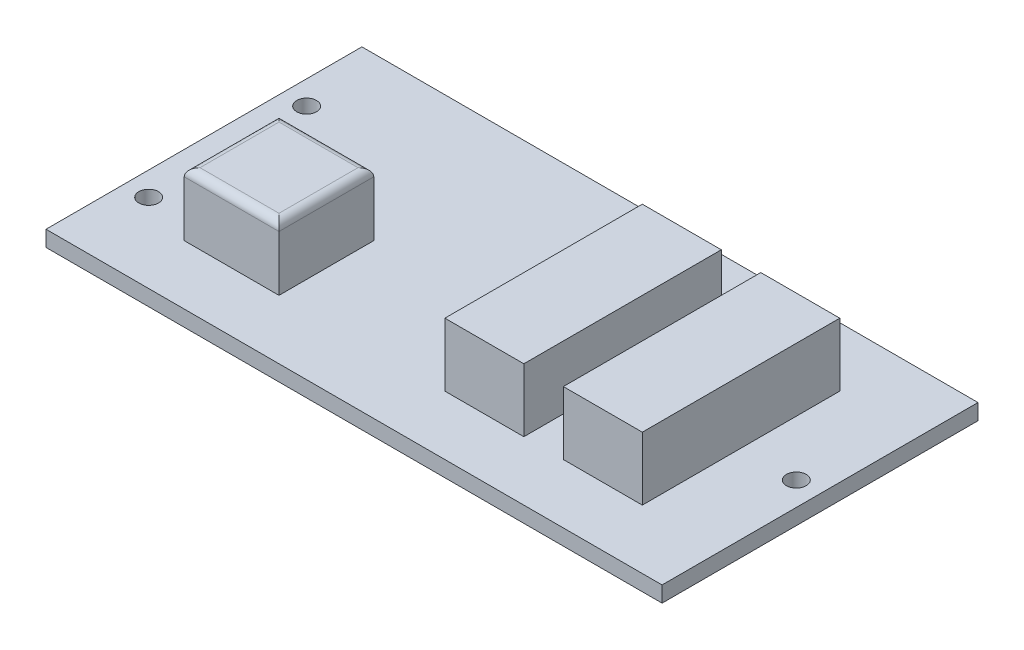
ISO-10303-21;
HEADER;
FILE_DESCRIPTION(('STEP AP214'),'2;1');
FILE_NAME('part.step','',(''),(''),'','','');
FILE_SCHEMA(('AUTOMOTIVE_DESIGN { 1 0 10303 214 1 1 1 1 }'));
ENDSEC;
DATA;
#1=APPLICATION_CONTEXT('core data for automotive mechanical design processes');
#2=APPLICATION_PROTOCOL_DEFINITION('international standard','automotive_design',2000,#1);
#3=PRODUCT_CONTEXT('',#1,'mechanical');
#4=PRODUCT('Part','Part','',(#3));
#5=PRODUCT_RELATED_PRODUCT_CATEGORY('part','',(#4));
#6=PRODUCT_DEFINITION_FORMATION('','',#4);
#7=PRODUCT_DEFINITION_CONTEXT('part definition',#1,'design');
#8=PRODUCT_DEFINITION('design','',#6,#7);
#9=PRODUCT_DEFINITION_SHAPE('','',#8);
#10=(LENGTH_UNIT() NAMED_UNIT(*) SI_UNIT(.MILLI.,.METRE.));
#11=(NAMED_UNIT(*) PLANE_ANGLE_UNIT() SI_UNIT($,.RADIAN.));
#12=(NAMED_UNIT(*) SI_UNIT($,.STERADIAN.) SOLID_ANGLE_UNIT());
#13=UNCERTAINTY_MEASURE_WITH_UNIT(LENGTH_MEASURE(1.E-05),#10,'distance_accuracy_value','');
#14=(GEOMETRIC_REPRESENTATION_CONTEXT(3) GLOBAL_UNCERTAINTY_ASSIGNED_CONTEXT((#13)) GLOBAL_UNIT_ASSIGNED_CONTEXT((#10,
#11,#12)) REPRESENTATION_CONTEXT('',''));
#15=CARTESIAN_POINT('',(0.,0.,0.));
#16=DIRECTION('',(0.,0.,1.));
#17=DIRECTION('',(1.,0.,0.));
#18=AXIS2_PLACEMENT_3D('',#15,#16,#17);
#19=CARTESIAN_POINT('',(-39.,2.,20.));
#20=DIRECTION('',(0.,1.,0.));
#21=DIRECTION('',(0.,0.,1.));
#22=AXIS2_PLACEMENT_3D('',#19,#20,#21);
#23=PLANE('',#22);
#24=CARTESIAN_POINT('',(-36.,2.,-10.));
#25=DIRECTION('',(0.,1.,0.));
#26=DIRECTION('',(0.,0.,1.));
#27=AXIS2_PLACEMENT_3D('',#24,#25,#26);
#28=CIRCLE('',#27,1.25000000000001);
#29=CARTESIAN_POINT('',(-36.,2.,-8.75));
#30=VERTEX_POINT('',#29);
#31=EDGE_CURVE('E299',#30,#30,#28,.T.);
#32=ORIENTED_EDGE('',*,*,#31,.F.);
#33=EDGE_LOOP('',(#32));
#34=FACE_BOUND('',#33,.T.);
#35=CARTESIAN_POINT('',(-36.,2.,10.));
#36=DIRECTION('',(0.,1.,0.));
#37=DIRECTION('',(0.,0.,1.));
#38=AXIS2_PLACEMENT_3D('',#35,#36,#37);
#39=CIRCLE('',#38,1.25);
#40=CARTESIAN_POINT('',(-36.,2.,11.25));
#41=VERTEX_POINT('',#40);
#42=EDGE_CURVE('E310',#41,#41,#39,.T.);
#43=ORIENTED_EDGE('',*,*,#42,.F.);
#44=EDGE_LOOP('',(#43));
#45=FACE_BOUND('',#44,.T.);
#46=CARTESIAN_POINT('',(36.,2.,0.));
#47=DIRECTION('',(0.,1.,0.));
#48=DIRECTION('',(0.,0.,1.));
#49=AXIS2_PLACEMENT_3D('',#46,#47,#48);
#50=CIRCLE('',#49,1.25000000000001);
#51=CARTESIAN_POINT('',(36.,2.,1.24999999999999));
#52=VERTEX_POINT('',#51);
#53=EDGE_CURVE('E316',#52,#52,#50,.T.);
#54=ORIENTED_EDGE('',*,*,#53,.F.);
#55=EDGE_LOOP('',(#54));
#56=FACE_BOUND('',#55,.T.);
#57=DIRECTION('',(-1.,0.,0.));
#58=VECTOR('',#57,1.);
#59=CARTESIAN_POINT('',(14.,2.,-12.5));
#60=LINE('',#59,#58);
#61=CARTESIAN_POINT('',(14.,2.,-12.5));
#62=VERTEX_POINT('',#61);
#63=CARTESIAN_POINT('',(3.99999999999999,2.,-12.5));
#64=VERTEX_POINT('',#63);
#65=EDGE_CURVE('E183',#62,#64,#60,.T.);
#66=ORIENTED_EDGE('',*,*,#65,.F.);
#67=DIRECTION('',(0.,0.,-1.));
#68=VECTOR('',#67,1.);
#69=CARTESIAN_POINT('',(14.,2.,-12.5));
#70=LINE('',#69,#68);
#71=CARTESIAN_POINT('',(14.,2.,12.5));
#72=VERTEX_POINT('',#71);
#73=EDGE_CURVE('E156',#72,#62,#70,.T.);
#74=ORIENTED_EDGE('',*,*,#73,.F.);
#75=DIRECTION('',(1.,0.,0.));
#76=VECTOR('',#75,1.);
#77=CARTESIAN_POINT('',(14.,2.,12.5));
#78=LINE('',#77,#76);
#79=CARTESIAN_POINT('',(4.,2.,12.5));
#80=VERTEX_POINT('',#79);
#81=EDGE_CURVE('E188',#80,#72,#78,.T.);
#82=ORIENTED_EDGE('',*,*,#81,.F.);
#83=DIRECTION('',(0.,0.,1.));
#84=VECTOR('',#83,1.);
#85=CARTESIAN_POINT('',(3.99999999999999,2.,-12.5));
#86=LINE('',#85,#84);
#87=EDGE_CURVE('E185',#64,#80,#86,.T.);
#88=ORIENTED_EDGE('',*,*,#87,.F.);
#89=EDGE_LOOP('',(#66,#74,#82,#88));
#90=FACE_BOUND('',#89,.T.);
#91=DIRECTION('',(0.,0.,1.));
#92=VECTOR('',#91,1.);
#93=CARTESIAN_POINT('',(-39.,2.,-20.));
#94=LINE('',#93,#92);
#95=CARTESIAN_POINT('',(-39.,2.,-20.));
#96=VERTEX_POINT('',#95);
#97=CARTESIAN_POINT('',(-39.,2.,20.));
#98=VERTEX_POINT('',#97);
#99=EDGE_CURVE('E247',#96,#98,#94,.T.);
#100=ORIENTED_EDGE('',*,*,#99,.T.);
#101=DIRECTION('',(1.,0.,0.));
#102=VECTOR('',#101,1.);
#103=CARTESIAN_POINT('',(-39.,2.,20.));
#104=LINE('',#103,#102);
#105=CARTESIAN_POINT('',(39.,2.,20.));
#106=VERTEX_POINT('',#105);
#107=EDGE_CURVE('E250',#98,#106,#104,.T.);
#108=ORIENTED_EDGE('',*,*,#107,.T.);
#109=DIRECTION('',(0.,0.,-1.));
#110=VECTOR('',#109,1.);
#111=CARTESIAN_POINT('',(39.,2.,-20.));
#112=LINE('',#111,#110);
#113=CARTESIAN_POINT('',(39.,2.,-20.));
#114=VERTEX_POINT('',#113);
#115=EDGE_CURVE('E252',#106,#114,#112,.T.);
#116=ORIENTED_EDGE('',*,*,#115,.T.);
#117=DIRECTION('',(-1.,0.,0.));
#118=VECTOR('',#117,1.);
#119=CARTESIAN_POINT('',(-39.,2.,-20.));
#120=LINE('',#119,#118);
#121=EDGE_CURVE('E254',#114,#96,#120,.T.);
#122=ORIENTED_EDGE('',*,*,#121,.T.);
#123=EDGE_LOOP('',(#100,#108,#116,#122));
#124=FACE_BOUND('',#123,.T.);
#125=DIRECTION('',(-1.,0.,0.));
#126=VECTOR('',#125,1.);
#127=CARTESIAN_POINT('',(29.,2.,-12.5));
#128=LINE('',#127,#126);
#129=CARTESIAN_POINT('',(29.,2.,-12.5));
#130=VERTEX_POINT('',#129);
#131=CARTESIAN_POINT('',(19.,2.,-12.5));
#132=VERTEX_POINT('',#131);
#133=EDGE_CURVE('E212',#130,#132,#128,.T.);
#134=ORIENTED_EDGE('',*,*,#133,.F.);
#135=DIRECTION('',(0.,0.,-1.));
#136=VECTOR('',#135,1.);
#137=CARTESIAN_POINT('',(29.,2.,-12.5));
#138=LINE('',#137,#136);
#139=CARTESIAN_POINT('',(29.,2.,12.5));
#140=VERTEX_POINT('',#139);
#141=EDGE_CURVE('E209',#140,#130,#138,.T.);
#142=ORIENTED_EDGE('',*,*,#141,.F.);
#143=DIRECTION('',(1.,0.,0.));
#144=VECTOR('',#143,1.);
#145=CARTESIAN_POINT('',(29.,2.,12.5));
#146=LINE('',#145,#144);
#147=CARTESIAN_POINT('',(19.,2.,12.5));
#148=VERTEX_POINT('',#147);
#149=EDGE_CURVE('E217',#148,#140,#146,.T.);
#150=ORIENTED_EDGE('',*,*,#149,.F.);
#151=DIRECTION('',(0.,0.,1.));
#152=VECTOR('',#151,1.);
#153=CARTESIAN_POINT('',(19.,2.,-12.5));
#154=LINE('',#153,#152);
#155=EDGE_CURVE('E214',#132,#148,#154,.T.);
#156=ORIENTED_EDGE('',*,*,#155,.F.);
#157=EDGE_LOOP('',(#134,#142,#150,#156));
#158=FACE_BOUND('',#157,.T.);
#159=DIRECTION('',(-1.,0.,0.));
#160=VECTOR('',#159,1.);
#161=CARTESIAN_POINT('',(-17.,2.,0.500000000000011));
#162=LINE('',#161,#160);
#163=CARTESIAN_POINT('',(-17.,2.,0.500000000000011));
#164=VERTEX_POINT('',#163);
#165=CARTESIAN_POINT('',(-29.,2.,0.500000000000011));
#166=VERTEX_POINT('',#165);
#167=EDGE_CURVE('E152',#164,#166,#162,.T.);
#168=ORIENTED_EDGE('',*,*,#167,.F.);
#169=DIRECTION('',(0.,0.,-1.));
#170=VECTOR('',#169,1.);
#171=CARTESIAN_POINT('',(-17.,2.,0.500000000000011));
#172=LINE('',#171,#170);
#173=CARTESIAN_POINT('',(-17.,2.,12.5));
#174=VERTEX_POINT('',#173);
#175=EDGE_CURVE('E160',#174,#164,#172,.T.);
#176=ORIENTED_EDGE('',*,*,#175,.F.);
#177=DIRECTION('',(1.,0.,0.));
#178=VECTOR('',#177,1.);
#179=CARTESIAN_POINT('',(-17.,2.,12.5));
#180=LINE('',#179,#178);
#181=CARTESIAN_POINT('',(-29.,2.,12.5));
#182=VERTEX_POINT('',#181);
#183=EDGE_CURVE('E172',#182,#174,#180,.T.);
#184=ORIENTED_EDGE('',*,*,#183,.F.);
#185=DIRECTION('',(0.,0.,1.));
#186=VECTOR('',#185,1.);
#187=CARTESIAN_POINT('',(-29.,2.,0.500000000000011));
#188=LINE('',#187,#186);
#189=EDGE_CURVE('E170',#166,#182,#188,.T.);
#190=ORIENTED_EDGE('',*,*,#189,.F.);
#191=EDGE_LOOP('',(#168,#176,#184,#190));
#192=FACE_BOUND('',#191,.T.);
#193=ADVANCED_FACE('F26',(#34,#45,#56,#90,#124,#158,#192),#23,.T.);
#194=CARTESIAN_POINT('',(-39.,2.,-20.));
#195=DIRECTION('',(1.,0.,0.));
#196=DIRECTION('',(0.,0.,-1.));
#197=AXIS2_PLACEMENT_3D('',#194,#195,#196);
#198=PLANE('',#197);
#199=DIRECTION('',(0.,0.,1.));
#200=VECTOR('',#199,1.);
#201=CARTESIAN_POINT('',(-39.,0.,-20.));
#202=LINE('',#201,#200);
#203=CARTESIAN_POINT('',(-39.,0.,-20.));
#204=VERTEX_POINT('',#203);
#205=CARTESIAN_POINT('',(-39.,0.,20.));
#206=VERTEX_POINT('',#205);
#207=EDGE_CURVE('E238',#204,#206,#202,.T.);
#208=ORIENTED_EDGE('',*,*,#207,.T.);
#209=DIRECTION('',(0.,-1.,0.));
#210=VECTOR('',#209,1.);
#211=CARTESIAN_POINT('',(-39.,2.,20.));
#212=LINE('',#211,#210);
#213=EDGE_CURVE('E265',#98,#206,#212,.T.);
#214=ORIENTED_EDGE('',*,*,#213,.F.);
#215=ORIENTED_EDGE('',*,*,#99,.F.);
#216=DIRECTION('',(0.,-1.,0.));
#217=VECTOR('',#216,1.);
#218=CARTESIAN_POINT('',(-39.,2.,-20.));
#219=LINE('',#218,#217);
#220=EDGE_CURVE('E256',#96,#204,#219,.T.);
#221=ORIENTED_EDGE('',*,*,#220,.T.);
#222=EDGE_LOOP('',(#208,#214,#215,#221));
#223=FACE_BOUND('',#222,.T.);
#224=ADVANCED_FACE('F28',(#223),#198,.F.);
#225=CARTESIAN_POINT('',(-39.,2.,20.));
#226=DIRECTION('',(0.,0.,-1.));
#227=DIRECTION('',(-1.,0.,0.));
#228=AXIS2_PLACEMENT_3D('',#225,#226,#227);
#229=PLANE('',#228);
#230=DIRECTION('',(1.,0.,0.));
#231=VECTOR('',#230,1.);
#232=CARTESIAN_POINT('',(-39.,0.,20.));
#233=LINE('',#232,#231);
#234=CARTESIAN_POINT('',(39.,0.,20.));
#235=VERTEX_POINT('',#234);
#236=EDGE_CURVE('E241',#206,#235,#233,.T.);
#237=ORIENTED_EDGE('',*,*,#236,.T.);
#238=DIRECTION('',(0.,-1.,0.));
#239=VECTOR('',#238,1.);
#240=CARTESIAN_POINT('',(39.,2.,20.));
#241=LINE('',#240,#239);
#242=EDGE_CURVE('E262',#106,#235,#241,.T.);
#243=ORIENTED_EDGE('',*,*,#242,.F.);
#244=ORIENTED_EDGE('',*,*,#107,.F.);
#245=ORIENTED_EDGE('',*,*,#213,.T.);
#246=EDGE_LOOP('',(#237,#243,#244,#245));
#247=FACE_BOUND('',#246,.T.);
#248=ADVANCED_FACE('F388',(#247),#229,.F.);
#249=CARTESIAN_POINT('',(39.,2.,-20.));
#250=DIRECTION('',(-1.,0.,0.));
#251=DIRECTION('',(0.,0.,1.));
#252=AXIS2_PLACEMENT_3D('',#249,#250,#251);
#253=PLANE('',#252);
#254=DIRECTION('',(0.,0.,-1.));
#255=VECTOR('',#254,1.);
#256=CARTESIAN_POINT('',(39.,0.,-20.));
#257=LINE('',#256,#255);
#258=CARTESIAN_POINT('',(39.,0.,-20.));
#259=VERTEX_POINT('',#258);
#260=EDGE_CURVE('E243',#235,#259,#257,.T.);
#261=ORIENTED_EDGE('',*,*,#260,.T.);
#262=DIRECTION('',(0.,-1.,0.));
#263=VECTOR('',#262,1.);
#264=CARTESIAN_POINT('',(39.,2.,-20.));
#265=LINE('',#264,#263);
#266=EDGE_CURVE('E259',#114,#259,#265,.T.);
#267=ORIENTED_EDGE('',*,*,#266,.F.);
#268=ORIENTED_EDGE('',*,*,#115,.F.);
#269=ORIENTED_EDGE('',*,*,#242,.T.);
#270=EDGE_LOOP('',(#261,#267,#268,#269));
#271=FACE_BOUND('',#270,.T.);
#272=ADVANCED_FACE('F385',(#271),#253,.F.);
#273=CARTESIAN_POINT('',(-39.,2.,-20.));
#274=DIRECTION('',(0.,0.,1.));
#275=DIRECTION('',(1.,0.,0.));
#276=AXIS2_PLACEMENT_3D('',#273,#274,#275);
#277=PLANE('',#276);
#278=DIRECTION('',(-1.,0.,0.));
#279=VECTOR('',#278,1.);
#280=CARTESIAN_POINT('',(-39.,0.,-20.));
#281=LINE('',#280,#279);
#282=EDGE_CURVE('E245',#259,#204,#281,.T.);
#283=ORIENTED_EDGE('',*,*,#282,.T.);
#284=ORIENTED_EDGE('',*,*,#220,.F.);
#285=ORIENTED_EDGE('',*,*,#121,.F.);
#286=ORIENTED_EDGE('',*,*,#266,.T.);
#287=EDGE_LOOP('',(#283,#284,#285,#286));
#288=FACE_BOUND('',#287,.T.);
#289=ADVANCED_FACE('F380',(#288),#277,.F.);
#290=CARTESIAN_POINT('',(-39.,0.,20.));
#291=DIRECTION('',(0.,1.,0.));
#292=DIRECTION('',(0.,0.,1.));
#293=AXIS2_PLACEMENT_3D('',#290,#291,#292);
#294=PLANE('',#293);
#295=CARTESIAN_POINT('',(-36.,0.,-10.));
#296=DIRECTION('',(0.,1.,0.));
#297=DIRECTION('',(0.,0.,1.));
#298=AXIS2_PLACEMENT_3D('',#295,#296,#297);
#299=CIRCLE('',#298,1.25000000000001);
#300=CARTESIAN_POINT('',(-36.,0.,-8.75));
#301=VERTEX_POINT('',#300);
#302=EDGE_CURVE('E302',#301,#301,#299,.T.);
#303=ORIENTED_EDGE('',*,*,#302,.T.);
#304=EDGE_LOOP('',(#303));
#305=FACE_BOUND('',#304,.T.);
#306=CARTESIAN_POINT('',(-36.,0.,10.));
#307=DIRECTION('',(0.,1.,0.));
#308=DIRECTION('',(0.,0.,1.));
#309=AXIS2_PLACEMENT_3D('',#306,#307,#308);
#310=CIRCLE('',#309,1.25);
#311=CARTESIAN_POINT('',(-36.,0.,11.25));
#312=VERTEX_POINT('',#311);
#313=EDGE_CURVE('E313',#312,#312,#310,.T.);
#314=ORIENTED_EDGE('',*,*,#313,.T.);
#315=EDGE_LOOP('',(#314));
#316=FACE_BOUND('',#315,.T.);
#317=CARTESIAN_POINT('',(36.,0.,0.));
#318=DIRECTION('',(0.,1.,0.));
#319=DIRECTION('',(0.,0.,1.));
#320=AXIS2_PLACEMENT_3D('',#317,#318,#319);
#321=CIRCLE('',#320,1.25000000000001);
#322=CARTESIAN_POINT('',(36.,0.,1.24999999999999));
#323=VERTEX_POINT('',#322);
#324=EDGE_CURVE('E167',#323,#323,#321,.T.);
#325=ORIENTED_EDGE('',*,*,#324,.T.);
#326=EDGE_LOOP('',(#325));
#327=FACE_BOUND('',#326,.T.);
#328=ORIENTED_EDGE('',*,*,#207,.F.);
#329=ORIENTED_EDGE('',*,*,#282,.F.);
#330=ORIENTED_EDGE('',*,*,#260,.F.);
#331=ORIENTED_EDGE('',*,*,#236,.F.);
#332=EDGE_LOOP('',(#328,#329,#330,#331));
#333=FACE_BOUND('',#332,.T.);
#334=ADVANCED_FACE('F321',(#305,#316,#327,#333),#294,.F.);
#335=CARTESIAN_POINT('',(29.,10.,-12.5));
#336=DIRECTION('',(-1.,0.,0.));
#337=DIRECTION('',(0.,0.,1.));
#338=AXIS2_PLACEMENT_3D('',#335,#336,#337);
#339=PLANE('',#338);
#340=ORIENTED_EDGE('',*,*,#141,.T.);
#341=DIRECTION('',(0.,-1.,0.));
#342=VECTOR('',#341,1.);
#343=CARTESIAN_POINT('',(29.,10.,-12.5));
#344=LINE('',#343,#342);
#345=CARTESIAN_POINT('',(29.,10.,-12.5));
#346=VERTEX_POINT('',#345);
#347=EDGE_CURVE('E236',#346,#130,#344,.T.);
#348=ORIENTED_EDGE('',*,*,#347,.F.);
#349=DIRECTION('',(0.,0.,-1.));
#350=VECTOR('',#349,1.);
#351=CARTESIAN_POINT('',(29.,10.,-12.5));
#352=LINE('',#351,#350);
#353=CARTESIAN_POINT('',(29.,10.,12.5));
#354=VERTEX_POINT('',#353);
#355=EDGE_CURVE('E219',#354,#346,#352,.T.);
#356=ORIENTED_EDGE('',*,*,#355,.F.);
#357=DIRECTION('',(0.,-1.,0.));
#358=VECTOR('',#357,1.);
#359=CARTESIAN_POINT('',(29.,10.,12.5));
#360=LINE('',#359,#358);
#361=EDGE_CURVE('E228',#354,#140,#360,.T.);
#362=ORIENTED_EDGE('',*,*,#361,.T.);
#363=EDGE_LOOP('',(#340,#348,#356,#362));
#364=FACE_BOUND('',#363,.T.);
#365=ADVANCED_FACE('F361',(#364),#339,.F.);
#366=CARTESIAN_POINT('',(29.,10.,-12.5));
#367=DIRECTION('',(0.,0.,1.));
#368=DIRECTION('',(1.,0.,0.));
#369=AXIS2_PLACEMENT_3D('',#366,#367,#368);
#370=PLANE('',#369);
#371=ORIENTED_EDGE('',*,*,#133,.T.);
#372=DIRECTION('',(0.,-1.,0.));
#373=VECTOR('',#372,1.);
#374=CARTESIAN_POINT('',(19.,10.,-12.5));
#375=LINE('',#374,#373);
#376=CARTESIAN_POINT('',(19.,10.,-12.5));
#377=VERTEX_POINT('',#376);
#378=EDGE_CURVE('E233',#377,#132,#375,.T.);
#379=ORIENTED_EDGE('',*,*,#378,.F.);
#380=DIRECTION('',(-1.,0.,0.));
#381=VECTOR('',#380,1.);
#382=CARTESIAN_POINT('',(29.,10.,-12.5));
#383=LINE('',#382,#381);
#384=EDGE_CURVE('E222',#346,#377,#383,.T.);
#385=ORIENTED_EDGE('',*,*,#384,.F.);
#386=ORIENTED_EDGE('',*,*,#347,.T.);
#387=EDGE_LOOP('',(#371,#379,#385,#386));
#388=FACE_BOUND('',#387,.T.);
#389=ADVANCED_FACE('F349',(#388),#370,.F.);
#390=CARTESIAN_POINT('',(19.,10.,-12.5));
#391=DIRECTION('',(1.,0.,0.));
#392=DIRECTION('',(0.,0.,-1.));
#393=AXIS2_PLACEMENT_3D('',#390,#391,#392);
#394=PLANE('',#393);
#395=ORIENTED_EDGE('',*,*,#155,.T.);
#396=DIRECTION('',(0.,-1.,0.));
#397=VECTOR('',#396,1.);
#398=CARTESIAN_POINT('',(19.,10.,12.5));
#399=LINE('',#398,#397);
#400=CARTESIAN_POINT('',(19.,10.,12.5));
#401=VERTEX_POINT('',#400);
#402=EDGE_CURVE('E231',#401,#148,#399,.T.);
#403=ORIENTED_EDGE('',*,*,#402,.F.);
#404=DIRECTION('',(0.,0.,1.));
#405=VECTOR('',#404,1.);
#406=CARTESIAN_POINT('',(19.,10.,-12.5));
#407=LINE('',#406,#405);
#408=EDGE_CURVE('E224',#377,#401,#407,.T.);
#409=ORIENTED_EDGE('',*,*,#408,.F.);
#410=ORIENTED_EDGE('',*,*,#378,.T.);
#411=EDGE_LOOP('',(#395,#403,#409,#410));
#412=FACE_BOUND('',#411,.T.);
#413=ADVANCED_FACE('F353',(#412),#394,.F.);
#414=CARTESIAN_POINT('',(29.,10.,12.5));
#415=DIRECTION('',(0.,0.,-1.));
#416=DIRECTION('',(-1.,0.,0.));
#417=AXIS2_PLACEMENT_3D('',#414,#415,#416);
#418=PLANE('',#417);
#419=ORIENTED_EDGE('',*,*,#149,.T.);
#420=ORIENTED_EDGE('',*,*,#361,.F.);
#421=DIRECTION('',(1.,0.,0.));
#422=VECTOR('',#421,1.);
#423=CARTESIAN_POINT('',(29.,10.,12.5));
#424=LINE('',#423,#422);
#425=EDGE_CURVE('E226',#401,#354,#424,.T.);
#426=ORIENTED_EDGE('',*,*,#425,.F.);
#427=ORIENTED_EDGE('',*,*,#402,.T.);
#428=EDGE_LOOP('',(#419,#420,#426,#427));
#429=FACE_BOUND('',#428,.T.);
#430=ADVANCED_FACE('F363',(#429),#418,.F.);
#431=CARTESIAN_POINT('',(29.,10.,12.5));
#432=DIRECTION('',(0.,-1.,0.));
#433=DIRECTION('',(0.,0.,-1.));
#434=AXIS2_PLACEMENT_3D('',#431,#432,#433);
#435=PLANE('',#434);
#436=ORIENTED_EDGE('',*,*,#355,.T.);
#437=ORIENTED_EDGE('',*,*,#384,.T.);
#438=ORIENTED_EDGE('',*,*,#408,.T.);
#439=ORIENTED_EDGE('',*,*,#425,.T.);
#440=EDGE_LOOP('',(#436,#437,#438,#439));
#441=FACE_BOUND('',#440,.T.);
#442=ADVANCED_FACE('F357',(#441),#435,.F.);
#443=CARTESIAN_POINT('',(14.,10.,-12.5));
#444=DIRECTION('',(-1.,0.,0.));
#445=DIRECTION('',(0.,0.,1.));
#446=AXIS2_PLACEMENT_3D('',#443,#444,#445);
#447=PLANE('',#446);
#448=ORIENTED_EDGE('',*,*,#73,.T.);
#449=DIRECTION('',(0.,-1.,0.));
#450=VECTOR('',#449,1.);
#451=CARTESIAN_POINT('',(14.,10.,-12.5));
#452=LINE('',#451,#450);
#453=CARTESIAN_POINT('',(14.,10.,-12.5));
#454=VERTEX_POINT('',#453);
#455=EDGE_CURVE('E207',#454,#62,#452,.T.);
#456=ORIENTED_EDGE('',*,*,#455,.F.);
#457=DIRECTION('',(0.,0.,-1.));
#458=VECTOR('',#457,1.);
#459=CARTESIAN_POINT('',(14.,10.,-12.5));
#460=LINE('',#459,#458);
#461=CARTESIAN_POINT('',(14.,10.,12.5));
#462=VERTEX_POINT('',#461);
#463=EDGE_CURVE('E190',#462,#454,#460,.T.);
#464=ORIENTED_EDGE('',*,*,#463,.F.);
#465=DIRECTION('',(0.,-1.,0.));
#466=VECTOR('',#465,1.);
#467=CARTESIAN_POINT('',(14.,10.,12.5));
#468=LINE('',#467,#466);
#469=EDGE_CURVE('E199',#462,#72,#468,.T.);
#470=ORIENTED_EDGE('',*,*,#469,.T.);
#471=EDGE_LOOP('',(#448,#456,#464,#470));
#472=FACE_BOUND('',#471,.T.);
#473=ADVANCED_FACE('F370',(#472),#447,.F.);
#474=CARTESIAN_POINT('',(14.,10.,-12.5));
#475=DIRECTION('',(0.,0.,1.));
#476=DIRECTION('',(1.,0.,0.));
#477=AXIS2_PLACEMENT_3D('',#474,#475,#476);
#478=PLANE('',#477);
#479=ORIENTED_EDGE('',*,*,#65,.T.);
#480=DIRECTION('',(0.,-1.,0.));
#481=VECTOR('',#480,1.);
#482=CARTESIAN_POINT('',(3.99999999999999,10.,-12.5));
#483=LINE('',#482,#481);
#484=CARTESIAN_POINT('',(3.99999999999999,10.,-12.5));
#485=VERTEX_POINT('',#484);
#486=EDGE_CURVE('E204',#485,#64,#483,.T.);
#487=ORIENTED_EDGE('',*,*,#486,.F.);
#488=DIRECTION('',(-1.,0.,0.));
#489=VECTOR('',#488,1.);
#490=CARTESIAN_POINT('',(14.,10.,-12.5));
#491=LINE('',#490,#489);
#492=EDGE_CURVE('E193',#454,#485,#491,.T.);
#493=ORIENTED_EDGE('',*,*,#492,.F.);
#494=ORIENTED_EDGE('',*,*,#455,.T.);
#495=EDGE_LOOP('',(#479,#487,#493,#494));
#496=FACE_BOUND('',#495,.T.);
#497=ADVANCED_FACE('F450',(#496),#478,.F.);
#498=CARTESIAN_POINT('',(3.99999999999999,10.,-12.5));
#499=DIRECTION('',(1.,0.,0.));
#500=DIRECTION('',(0.,0.,-1.));
#501=AXIS2_PLACEMENT_3D('',#498,#499,#500);
#502=PLANE('',#501);
#503=ORIENTED_EDGE('',*,*,#87,.T.);
#504=DIRECTION('',(0.,-1.,0.));
#505=VECTOR('',#504,1.);
#506=CARTESIAN_POINT('',(3.99999999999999,10.,12.5));
#507=LINE('',#506,#505);
#508=CARTESIAN_POINT('',(3.99999999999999,10.,12.5));
#509=VERTEX_POINT('',#508);
#510=EDGE_CURVE('E202',#509,#80,#507,.T.);
#511=ORIENTED_EDGE('',*,*,#510,.F.);
#512=DIRECTION('',(0.,0.,1.));
#513=VECTOR('',#512,1.);
#514=CARTESIAN_POINT('',(3.99999999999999,10.,-12.5));
#515=LINE('',#514,#513);
#516=EDGE_CURVE('E195',#485,#509,#515,.T.);
#517=ORIENTED_EDGE('',*,*,#516,.F.);
#518=ORIENTED_EDGE('',*,*,#486,.T.);
#519=EDGE_LOOP('',(#503,#511,#517,#518));
#520=FACE_BOUND('',#519,.T.);
#521=ADVANCED_FACE('F457',(#520),#502,.F.);
#522=CARTESIAN_POINT('',(14.,10.,12.5));
#523=DIRECTION('',(0.,0.,-1.));
#524=DIRECTION('',(-1.,0.,0.));
#525=AXIS2_PLACEMENT_3D('',#522,#523,#524);
#526=PLANE('',#525);
#527=ORIENTED_EDGE('',*,*,#81,.T.);
#528=ORIENTED_EDGE('',*,*,#469,.F.);
#529=DIRECTION('',(1.,0.,0.));
#530=VECTOR('',#529,1.);
#531=CARTESIAN_POINT('',(14.,10.,12.5));
#532=LINE('',#531,#530);
#533=EDGE_CURVE('E197',#509,#462,#532,.T.);
#534=ORIENTED_EDGE('',*,*,#533,.F.);
#535=ORIENTED_EDGE('',*,*,#510,.T.);
#536=EDGE_LOOP('',(#527,#528,#534,#535));
#537=FACE_BOUND('',#536,.T.);
#538=ADVANCED_FACE('F465',(#537),#526,.F.);
#539=CARTESIAN_POINT('',(14.,10.,12.5));
#540=DIRECTION('',(0.,-1.,0.));
#541=DIRECTION('',(0.,0.,-1.));
#542=AXIS2_PLACEMENT_3D('',#539,#540,#541);
#543=PLANE('',#542);
#544=ORIENTED_EDGE('',*,*,#463,.T.);
#545=ORIENTED_EDGE('',*,*,#492,.T.);
#546=ORIENTED_EDGE('',*,*,#516,.T.);
#547=ORIENTED_EDGE('',*,*,#533,.T.);
#548=EDGE_LOOP('',(#544,#545,#546,#547));
#549=FACE_BOUND('',#548,.T.);
#550=ADVANCED_FACE('F473',(#549),#543,.F.);
#551=CARTESIAN_POINT('',(-17.,10.,0.500000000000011));
#552=DIRECTION('',(-1.,0.,0.));
#553=DIRECTION('',(0.,0.,1.));
#554=AXIS2_PLACEMENT_3D('',#551,#552,#553);
#555=PLANE('',#554);
#556=DIRECTION('',(0.,-1.,0.));
#557=VECTOR('',#556,1.);
#558=CARTESIAN_POINT('',(-17.,10.,0.500000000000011));
#559=LINE('',#558,#557);
#560=CARTESIAN_POINT('',(-17.,9.,0.500000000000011));
#561=VERTEX_POINT('',#560);
#562=EDGE_CURVE('E148',#561,#164,#559,.T.);
#563=ORIENTED_EDGE('',*,*,#562,.F.);
#564=DIRECTION('',(0.,0.,-1.));
#565=VECTOR('',#564,1.);
#566=CARTESIAN_POINT('',(-17.,9.,0.500000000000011));
#567=LINE('',#566,#565);
#568=CARTESIAN_POINT('',(-17.,9.,12.5));
#569=VERTEX_POINT('',#568);
#570=EDGE_CURVE('E11',#561,#569,#567,.F.);
#571=ORIENTED_EDGE('',*,*,#570,.T.);
#572=DIRECTION('',(0.,-1.,0.));
#573=VECTOR('',#572,1.);
#574=CARTESIAN_POINT('',(-17.,10.,12.5));
#575=LINE('',#574,#573);
#576=EDGE_CURVE('E163',#569,#174,#575,.T.);
#577=ORIENTED_EDGE('',*,*,#576,.T.);
#578=ORIENTED_EDGE('',*,*,#175,.T.);
#579=EDGE_LOOP('',(#563,#571,#577,#578));
#580=FACE_BOUND('',#579,.T.);
#581=ADVANCED_FACE('F161',(#580),#555,.F.);
#582=CARTESIAN_POINT('',(-17.,10.,0.500000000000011));
#583=DIRECTION('',(0.,0.,1.));
#584=DIRECTION('',(1.,0.,0.));
#585=AXIS2_PLACEMENT_3D('',#582,#583,#584);
#586=PLANE('',#585);
#587=DIRECTION('',(0.,-1.,0.));
#588=VECTOR('',#587,1.);
#589=CARTESIAN_POINT('',(-29.,10.,0.500000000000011));
#590=LINE('',#589,#588);
#591=CARTESIAN_POINT('',(-29.,9.,0.500000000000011));
#592=VERTEX_POINT('',#591);
#593=EDGE_CURVE('E157',#592,#166,#590,.T.);
#594=ORIENTED_EDGE('',*,*,#593,.F.);
#595=DIRECTION('',(-1.,0.,0.));
#596=VECTOR('',#595,1.);
#597=CARTESIAN_POINT('',(-17.,9.,0.500000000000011));
#598=LINE('',#597,#596);
#599=EDGE_CURVE('E34',#592,#561,#598,.F.);
#600=ORIENTED_EDGE('',*,*,#599,.T.);
#601=ORIENTED_EDGE('',*,*,#562,.T.);
#602=ORIENTED_EDGE('',*,*,#167,.T.);
#603=EDGE_LOOP('',(#594,#600,#601,#602));
#604=FACE_BOUND('',#603,.T.);
#605=ADVANCED_FACE('F150',(#604),#586,.F.);
#606=CARTESIAN_POINT('',(-29.,10.,0.500000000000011));
#607=DIRECTION('',(1.,0.,0.));
#608=DIRECTION('',(0.,0.,-1.));
#609=AXIS2_PLACEMENT_3D('',#606,#607,#608);
#610=PLANE('',#609);
#611=DIRECTION('',(0.,-1.,0.));
#612=VECTOR('',#611,1.);
#613=CARTESIAN_POINT('',(-29.,10.,12.5));
#614=LINE('',#613,#612);
#615=CARTESIAN_POINT('',(-29.,9.,12.5));
#616=VERTEX_POINT('',#615);
#617=EDGE_CURVE('E178',#616,#182,#614,.T.);
#618=ORIENTED_EDGE('',*,*,#617,.F.);
#619=DIRECTION('',(0.,0.,1.));
#620=VECTOR('',#619,1.);
#621=CARTESIAN_POINT('',(-29.,9.,0.500000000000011));
#622=LINE('',#621,#620);
#623=EDGE_CURVE('E48',#616,#592,#622,.F.);
#624=ORIENTED_EDGE('',*,*,#623,.T.);
#625=ORIENTED_EDGE('',*,*,#593,.T.);
#626=ORIENTED_EDGE('',*,*,#189,.T.);
#627=EDGE_LOOP('',(#618,#624,#625,#626));
#628=FACE_BOUND('',#627,.T.);
#629=ADVANCED_FACE('F285',(#628),#610,.F.);
#630=CARTESIAN_POINT('',(-17.,10.,12.5));
#631=DIRECTION('',(0.,0.,-1.));
#632=DIRECTION('',(-1.,0.,0.));
#633=AXIS2_PLACEMENT_3D('',#630,#631,#632);
#634=PLANE('',#633);
#635=ORIENTED_EDGE('',*,*,#576,.F.);
#636=DIRECTION('',(1.,0.,0.));
#637=VECTOR('',#636,1.);
#638=CARTESIAN_POINT('',(-17.,9.,12.5));
#639=LINE('',#638,#637);
#640=EDGE_CURVE('E277',#569,#616,#639,.F.);
#641=ORIENTED_EDGE('',*,*,#640,.T.);
#642=ORIENTED_EDGE('',*,*,#617,.T.);
#643=ORIENTED_EDGE('',*,*,#183,.T.);
#644=EDGE_LOOP('',(#635,#641,#642,#643));
#645=FACE_BOUND('',#644,.T.);
#646=ADVANCED_FACE('F282',(#645),#634,.F.);
#647=CARTESIAN_POINT('',(-17.,10.,12.5));
#648=DIRECTION('',(0.,-1.,0.));
#649=DIRECTION('',(0.,0.,-1.));
#650=AXIS2_PLACEMENT_3D('',#647,#648,#649);
#651=PLANE('',#650);
#652=DIRECTION('',(0.,0.,1.));
#653=VECTOR('',#652,1.);
#654=CARTESIAN_POINT('',(-28.,10.,12.5));
#655=LINE('',#654,#653);
#656=CARTESIAN_POINT('',(-28.,10.,1.50000000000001));
#657=VERTEX_POINT('',#656);
#658=CARTESIAN_POINT('',(-28.,10.,11.5));
#659=VERTEX_POINT('',#658);
#660=EDGE_CURVE('E272',#657,#659,#655,.T.);
#661=ORIENTED_EDGE('',*,*,#660,.T.);
#662=DIRECTION('',(1.,0.,0.));
#663=VECTOR('',#662,1.);
#664=CARTESIAN_POINT('',(-17.,10.,11.5));
#665=LINE('',#664,#663);
#666=CARTESIAN_POINT('',(-18.,10.,11.5));
#667=VERTEX_POINT('',#666);
#668=EDGE_CURVE('E274',#659,#667,#665,.T.);
#669=ORIENTED_EDGE('',*,*,#668,.T.);
#670=DIRECTION('',(0.,0.,-1.));
#671=VECTOR('',#670,1.);
#672=CARTESIAN_POINT('',(-18.,10.,12.5));
#673=LINE('',#672,#671);
#674=CARTESIAN_POINT('',(-18.,10.,1.50000000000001));
#675=VERTEX_POINT('',#674);
#676=EDGE_CURVE('E268',#667,#675,#673,.T.);
#677=ORIENTED_EDGE('',*,*,#676,.T.);
#678=DIRECTION('',(-1.,0.,0.));
#679=VECTOR('',#678,1.);
#680=CARTESIAN_POINT('',(-17.,10.,1.50000000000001));
#681=LINE('',#680,#679);
#682=EDGE_CURVE('E270',#675,#657,#681,.T.);
#683=ORIENTED_EDGE('',*,*,#682,.T.);
#684=EDGE_LOOP('',(#661,#669,#677,#683));
#685=FACE_BOUND('',#684,.T.);
#686=ADVANCED_FACE('F328',(#685),#651,.F.);
#687=CARTESIAN_POINT('',(36.,0.,0.));
#688=DIRECTION('',(0.,1.,0.));
#689=DIRECTION('',(0.,0.,1.));
#690=AXIS2_PLACEMENT_3D('',#687,#688,#689);
#691=CYLINDRICAL_SURFACE('',#690,1.25000000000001);
#692=ORIENTED_EDGE('',*,*,#324,.F.);
#693=EDGE_LOOP('',(#692));
#694=FACE_BOUND('',#693,.T.);
#695=ORIENTED_EDGE('',*,*,#53,.T.);
#696=EDGE_LOOP('',(#695));
#697=FACE_BOUND('',#696,.T.);
#698=ADVANCED_FACE('F324',(#694,#697),#691,.F.);
#699=CARTESIAN_POINT('',(-36.,0.,10.));
#700=DIRECTION('',(0.,1.,0.));
#701=DIRECTION('',(0.,0.,1.));
#702=AXIS2_PLACEMENT_3D('',#699,#700,#701);
#703=CYLINDRICAL_SURFACE('',#702,1.25);
#704=ORIENTED_EDGE('',*,*,#313,.F.);
#705=EDGE_LOOP('',(#704));
#706=FACE_BOUND('',#705,.T.);
#707=ORIENTED_EDGE('',*,*,#42,.T.);
#708=EDGE_LOOP('',(#707));
#709=FACE_BOUND('',#708,.T.);
#710=ADVANCED_FACE('F327',(#706,#709),#703,.F.);
#711=CARTESIAN_POINT('',(-36.,0.,-10.));
#712=DIRECTION('',(0.,1.,0.));
#713=DIRECTION('',(0.,0.,1.));
#714=AXIS2_PLACEMENT_3D('',#711,#712,#713);
#715=CYLINDRICAL_SURFACE('',#714,1.25000000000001);
#716=ORIENTED_EDGE('',*,*,#302,.F.);
#717=EDGE_LOOP('',(#716));
#718=FACE_BOUND('',#717,.T.);
#719=ORIENTED_EDGE('',*,*,#31,.T.);
#720=EDGE_LOOP('',(#719));
#721=FACE_BOUND('',#720,.T.);
#722=ADVANCED_FACE('F524',(#718,#721),#715,.F.);
#723=CARTESIAN_POINT('',(-17.,9.,1.50000000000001));
#724=DIRECTION('',(-1.,0.,0.));
#725=DIRECTION('',(0.,0.,1.));
#726=AXIS2_PLACEMENT_3D('',#723,#724,#725);
#727=CYLINDRICAL_SURFACE('',#726,1.);
#728=CARTESIAN_POINT('',(-18.,9.,1.50000000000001));
#729=DIRECTION('',(-0.707106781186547,0.,-0.707106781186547));
#730=DIRECTION('',(0.707106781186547,0.,-0.707106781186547));
#731=AXIS2_PLACEMENT_3D('',#728,#729,#730);
#732=ELLIPSE('',#731,1.41421356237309,1.);
#733=EDGE_CURVE('E294',#561,#675,#732,.F.);
#734=ORIENTED_EDGE('',*,*,#733,.F.);
#735=ORIENTED_EDGE('',*,*,#599,.F.);
#736=CARTESIAN_POINT('',(-28.,9.,1.50000000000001));
#737=DIRECTION('',(-0.707106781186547,0.,0.707106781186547));
#738=DIRECTION('',(-0.707106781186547,0.,-0.707106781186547));
#739=AXIS2_PLACEMENT_3D('',#736,#737,#738);
#740=ELLIPSE('',#739,1.41421356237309,1.);
#741=EDGE_CURVE('E291',#657,#592,#740,.T.);
#742=ORIENTED_EDGE('',*,*,#741,.F.);
#743=ORIENTED_EDGE('',*,*,#682,.F.);
#744=EDGE_LOOP('',(#734,#735,#742,#743));
#745=FACE_BOUND('',#744,.T.);
#746=ADVANCED_FACE('F289',(#745),#727,.T.);
#747=CARTESIAN_POINT('',(-28.,9.,12.5));
#748=DIRECTION('',(0.,0.,1.));
#749=DIRECTION('',(1.,0.,0.));
#750=AXIS2_PLACEMENT_3D('',#747,#748,#749);
#751=CYLINDRICAL_SURFACE('',#750,1.);
#752=ORIENTED_EDGE('',*,*,#741,.T.);
#753=ORIENTED_EDGE('',*,*,#623,.F.);
#754=CARTESIAN_POINT('',(-28.,9.,11.5));
#755=DIRECTION('',(0.707106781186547,0.,0.707106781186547));
#756=DIRECTION('',(-0.707106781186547,0.,0.707106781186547));
#757=AXIS2_PLACEMENT_3D('',#754,#755,#756);
#758=ELLIPSE('',#757,1.41421356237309,1.);
#759=EDGE_CURVE('E304',#659,#616,#758,.T.);
#760=ORIENTED_EDGE('',*,*,#759,.F.);
#761=ORIENTED_EDGE('',*,*,#660,.F.);
#762=EDGE_LOOP('',(#752,#753,#760,#761));
#763=FACE_BOUND('',#762,.T.);
#764=ADVANCED_FACE('F297',(#763),#751,.T.);
#765=CARTESIAN_POINT('',(-18.,9.,12.5));
#766=DIRECTION('',(0.,0.,-1.));
#767=DIRECTION('',(-1.,0.,0.));
#768=AXIS2_PLACEMENT_3D('',#765,#766,#767);
#769=CYLINDRICAL_SURFACE('',#768,1.);
#770=ORIENTED_EDGE('',*,*,#733,.T.);
#771=ORIENTED_EDGE('',*,*,#676,.F.);
#772=CARTESIAN_POINT('',(-18.,9.,11.5));
#773=DIRECTION('',(0.707106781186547,0.,-0.707106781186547));
#774=DIRECTION('',(-0.707106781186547,0.,-0.707106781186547));
#775=AXIS2_PLACEMENT_3D('',#772,#773,#774);
#776=ELLIPSE('',#775,1.41421356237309,1.);
#777=EDGE_CURVE('E560',#569,#667,#776,.F.);
#778=ORIENTED_EDGE('',*,*,#777,.F.);
#779=ORIENTED_EDGE('',*,*,#570,.F.);
#780=EDGE_LOOP('',(#770,#771,#778,#779));
#781=FACE_BOUND('',#780,.T.);
#782=ADVANCED_FACE('F543',(#781),#769,.T.);
#783=CARTESIAN_POINT('',(-17.,9.,11.5));
#784=DIRECTION('',(1.,0.,0.));
#785=DIRECTION('',(0.,0.,-1.));
#786=AXIS2_PLACEMENT_3D('',#783,#784,#785);
#787=CYLINDRICAL_SURFACE('',#786,1.);
#788=ORIENTED_EDGE('',*,*,#759,.T.);
#789=ORIENTED_EDGE('',*,*,#640,.F.);
#790=ORIENTED_EDGE('',*,*,#777,.T.);
#791=ORIENTED_EDGE('',*,*,#668,.F.);
#792=EDGE_LOOP('',(#788,#789,#790,#791));
#793=FACE_BOUND('',#792,.T.);
#794=ADVANCED_FACE('F550',(#793),#787,.T.);
#795=CLOSED_SHELL('',(#193,#224,#248,#272,#289,#334,#365,#389,#413,#430,#442,#473,#497,#521,
#538,#550,#581,#605,#629,#646,#686,#698,#710,#722,#746,#764,#782,#794));
#796=MANIFOLD_SOLID_BREP('B2',#795);
#797=ADVANCED_BREP_SHAPE_REPRESENTATION('',(#18,#796),#14);
#798=SHAPE_DEFINITION_REPRESENTATION(#9,#797);
ENDSEC;
END-ISO-10303-21;
